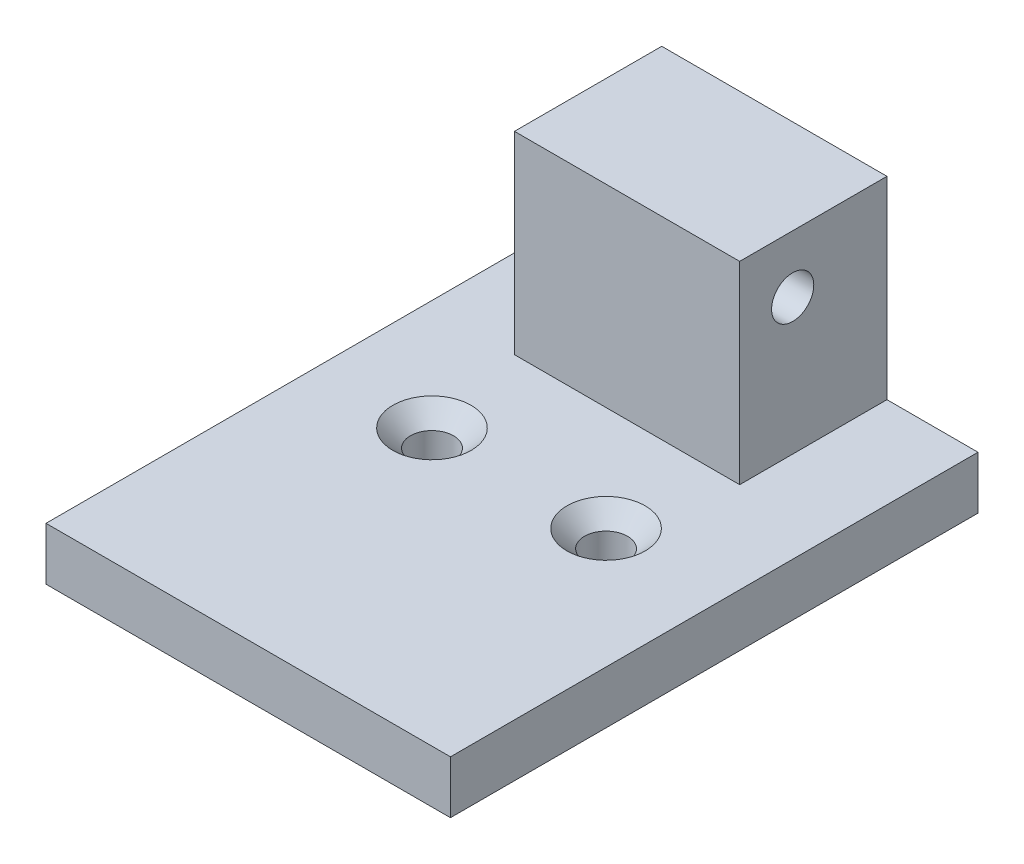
ISO-10303-21;
HEADER;
FILE_DESCRIPTION(('STEP AP214'),'2;1');
FILE_NAME('part.step','',(''),(''),'','','');
FILE_SCHEMA(('AUTOMOTIVE_DESIGN { 1 0 10303 214 1 1 1 1 }'));
ENDSEC;
DATA;
#1=APPLICATION_CONTEXT('core data for automotive mechanical design processes');
#2=APPLICATION_PROTOCOL_DEFINITION('international standard','automotive_design',2000,#1);
#3=PRODUCT_CONTEXT('',#1,'mechanical');
#4=PRODUCT('Part','Part','',(#3));
#5=PRODUCT_RELATED_PRODUCT_CATEGORY('part','',(#4));
#6=PRODUCT_DEFINITION_FORMATION('','',#4);
#7=PRODUCT_DEFINITION_CONTEXT('part definition',#1,'design');
#8=PRODUCT_DEFINITION('design','',#6,#7);
#9=PRODUCT_DEFINITION_SHAPE('','',#8);
#10=(LENGTH_UNIT() NAMED_UNIT(*) SI_UNIT(.MILLI.,.METRE.));
#11=(NAMED_UNIT(*) PLANE_ANGLE_UNIT() SI_UNIT($,.RADIAN.));
#12=(NAMED_UNIT(*) SI_UNIT($,.STERADIAN.) SOLID_ANGLE_UNIT());
#13=UNCERTAINTY_MEASURE_WITH_UNIT(LENGTH_MEASURE(1.E-05),#10,'distance_accuracy_value','');
#14=(GEOMETRIC_REPRESENTATION_CONTEXT(3) GLOBAL_UNCERTAINTY_ASSIGNED_CONTEXT((#13)) GLOBAL_UNIT_ASSIGNED_CONTEXT((#10,
#11,#12)) REPRESENTATION_CONTEXT('',''));
#15=CARTESIAN_POINT('',(0.,0.,0.));
#16=DIRECTION('',(0.,0.,1.));
#17=DIRECTION('',(1.,0.,0.));
#18=AXIS2_PLACEMENT_3D('',#15,#16,#17);
#19=CARTESIAN_POINT('',(0.,14.,0.));
#20=DIRECTION('',(0.,1.,0.));
#21=DIRECTION('',(0.,0.,1.));
#22=AXIS2_PLACEMENT_3D('',#19,#20,#21);
#23=PLANE('',#22);
#24=DIRECTION('',(-1.,0.,0.));
#25=VECTOR('',#24,1.);
#26=CARTESIAN_POINT('',(-20.2405151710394,14.,-5.94913889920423));
#27=LINE('',#26,#25);
#28=CARTESIAN_POINT('',(-20.9405151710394,14.,-5.94913889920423));
#29=VERTEX_POINT('',#28);
#30=CARTESIAN_POINT('',(-33.7485249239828,14.,-5.94913889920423));
#31=VERTEX_POINT('',#30);
#32=EDGE_CURVE('E115',#29,#31,#27,.T.);
#33=ORIENTED_EDGE('',*,*,#32,.F.);
#34=DIRECTION('',(0.,0.,1.));
#35=VECTOR('',#34,1.);
#36=CARTESIAN_POINT('',(-20.9405151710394,14.,-14.3252654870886));
#37=LINE('',#36,#35);
#38=CARTESIAN_POINT('',(-20.9405151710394,14.,-14.3252654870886));
#39=VERTEX_POINT('',#38);
#40=EDGE_CURVE('E50',#39,#29,#37,.T.);
#41=ORIENTED_EDGE('',*,*,#40,.F.);
#42=DIRECTION('',(-1.,0.,0.));
#43=VECTOR('',#42,1.);
#44=CARTESIAN_POINT('',(-34.4485249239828,14.,-14.3252654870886));
#45=LINE('',#44,#43);
#46=CARTESIAN_POINT('',(-33.7485249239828,14.,-14.3252654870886));
#47=VERTEX_POINT('',#46);
#48=EDGE_CURVE('E113',#39,#47,#45,.T.);
#49=ORIENTED_EDGE('',*,*,#48,.T.);
#50=DIRECTION('',(0.,0.,-1.));
#51=VECTOR('',#50,1.);
#52=CARTESIAN_POINT('',(-33.7485249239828,14.,-14.3252654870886));
#53=LINE('',#52,#51);
#54=EDGE_CURVE('E345',#31,#47,#53,.T.);
#55=ORIENTED_EDGE('',*,*,#54,.F.);
#56=EDGE_LOOP('',(#33,#41,#49,#55));
#57=FACE_BOUND('',#56,.T.);
#58=ADVANCED_FACE('F35',(#57),#23,.T.);
#59=CARTESIAN_POINT('',(-8.44852492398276,10.7325870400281,-8.96255173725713));
#60=DIRECTION('',(-1.,0.,0.));
#61=DIRECTION('',(0.,0.,1.));
#62=AXIS2_PLACEMENT_3D('',#59,#60,#61);
#63=CYLINDRICAL_SURFACE('',#62,1.2);
#64=CARTESIAN_POINT('',(-33.7485249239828,10.7325870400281,-8.96255173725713));
#65=DIRECTION('',(1.,0.,0.));
#66=DIRECTION('',(0.,0.,-1.));
#67=AXIS2_PLACEMENT_3D('',#64,#65,#66);
#68=CIRCLE('',#67,1.2);
#69=CARTESIAN_POINT('',(-33.7485249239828,10.7325870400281,-10.1625517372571));
#70=VERTEX_POINT('',#69);
#71=EDGE_CURVE('E354',#70,#70,#68,.F.);
#72=ORIENTED_EDGE('',*,*,#71,.T.);
#73=EDGE_LOOP('',(#72));
#74=FACE_BOUND('',#73,.T.);
#75=CARTESIAN_POINT('',(-20.9405151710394,10.7325870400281,-8.96255173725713));
#76=DIRECTION('',(1.,0.,0.));
#77=DIRECTION('',(0.,0.,-1.));
#78=AXIS2_PLACEMENT_3D('',#75,#76,#77);
#79=CIRCLE('',#78,1.2);
#80=CARTESIAN_POINT('',(-20.9405151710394,10.7325870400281,-10.1625517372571));
#81=VERTEX_POINT('',#80);
#82=EDGE_CURVE('E346',#81,#81,#79,.F.);
#83=ORIENTED_EDGE('',*,*,#82,.F.);
#84=EDGE_LOOP('',(#83));
#85=FACE_BOUND('',#84,.T.);
#86=ADVANCED_FACE('F202',(#74,#85),#63,.F.);
#87=CARTESIAN_POINT('',(0.,0.,-5.94913889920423));
#88=DIRECTION('',(0.,0.,1.));
#89=DIRECTION('',(1.,0.,0.));
#90=AXIS2_PLACEMENT_3D('',#87,#88,#89);
#91=PLANE('',#90);
#92=DIRECTION('',(1.,0.,0.));
#93=VECTOR('',#92,1.);
#94=CARTESIAN_POINT('',(-20.2405151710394,3.,-5.94913889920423));
#95=LINE('',#94,#93);
#96=CARTESIAN_POINT('',(-33.7485249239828,3.,-5.94913889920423));
#97=VERTEX_POINT('',#96);
#98=CARTESIAN_POINT('',(-20.9405151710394,3.,-5.94913889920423));
#99=VERTEX_POINT('',#98);
#100=EDGE_CURVE('E122',#97,#99,#95,.T.);
#101=ORIENTED_EDGE('',*,*,#100,.T.);
#102=DIRECTION('',(0.,-1.,0.));
#103=VECTOR('',#102,1.);
#104=CARTESIAN_POINT('',(-20.9405151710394,3.,-5.94913889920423));
#105=LINE('',#104,#103);
#106=EDGE_CURVE('E116',#29,#99,#105,.T.);
#107=ORIENTED_EDGE('',*,*,#106,.F.);
#108=ORIENTED_EDGE('',*,*,#32,.T.);
#109=DIRECTION('',(0.,1.,0.));
#110=VECTOR('',#109,1.);
#111=CARTESIAN_POINT('',(-33.7485249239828,3.,-5.94913889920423));
#112=LINE('',#111,#110);
#113=EDGE_CURVE('E342',#97,#31,#112,.T.);
#114=ORIENTED_EDGE('',*,*,#113,.F.);
#115=EDGE_LOOP('',(#101,#107,#108,#114));
#116=FACE_BOUND('',#115,.T.);
#117=ADVANCED_FACE('F206',(#116),#91,.T.);
#118=CARTESIAN_POINT('',(0.,3.,0.));
#119=DIRECTION('',(0.,1.,0.));
#120=DIRECTION('',(0.,0.,1.));
#121=AXIS2_PLACEMENT_3D('',#118,#119,#120);
#122=PLANE('',#121);
#123=DIRECTION('',(-1.,0.,0.));
#124=VECTOR('',#123,1.);
#125=CARTESIAN_POINT('',(-38.763553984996,3.,-14.3252654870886));
#126=LINE('',#125,#124);
#127=CARTESIAN_POINT('',(-15.7635539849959,3.,-14.3252654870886));
#128=VERTEX_POINT('',#127);
#129=CARTESIAN_POINT('',(-20.9405151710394,3.,-14.3252654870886));
#130=VERTEX_POINT('',#129);
#131=EDGE_CURVE('E143',#128,#130,#126,.T.);
#132=ORIENTED_EDGE('',*,*,#131,.T.);
#133=DIRECTION('',(0.,0.,-1.));
#134=VECTOR('',#133,1.);
#135=CARTESIAN_POINT('',(-20.9405151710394,3.,-14.3252654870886));
#136=LINE('',#135,#134);
#137=EDGE_CURVE('E105',#99,#130,#136,.T.);
#138=ORIENTED_EDGE('',*,*,#137,.F.);
#139=ORIENTED_EDGE('',*,*,#100,.F.);
#140=DIRECTION('',(0.,0.,1.));
#141=VECTOR('',#140,1.);
#142=CARTESIAN_POINT('',(-33.7485249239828,3.,-14.3252654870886));
#143=LINE('',#142,#141);
#144=CARTESIAN_POINT('',(-33.7485249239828,3.,-14.3252654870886));
#145=VERTEX_POINT('',#144);
#146=EDGE_CURVE('E58',#145,#97,#143,.T.);
#147=ORIENTED_EDGE('',*,*,#146,.F.);
#148=CARTESIAN_POINT('',(-38.763553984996,3.,-14.3252654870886));
#149=VERTEX_POINT('',#148);
#150=EDGE_CURVE('E142',#145,#149,#126,.T.);
#151=ORIENTED_EDGE('',*,*,#150,.T.);
#152=DIRECTION('',(0.,0.,1.));
#153=VECTOR('',#152,1.);
#154=CARTESIAN_POINT('',(-38.763553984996,3.,-14.3252654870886));
#155=LINE('',#154,#153);
#156=CARTESIAN_POINT('',(-38.7635539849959,3.,15.6747345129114));
#157=VERTEX_POINT('',#156);
#158=EDGE_CURVE('E134',#149,#157,#155,.T.);
#159=ORIENTED_EDGE('',*,*,#158,.T.);
#160=DIRECTION('',(1.,0.,0.));
#161=VECTOR('',#160,1.);
#162=CARTESIAN_POINT('',(-38.7635539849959,3.,15.6747345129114));
#163=LINE('',#162,#161);
#164=CARTESIAN_POINT('',(-15.7635539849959,3.,15.6747345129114));
#165=VERTEX_POINT('',#164);
#166=EDGE_CURVE('E137',#157,#165,#163,.T.);
#167=ORIENTED_EDGE('',*,*,#166,.T.);
#168=DIRECTION('',(0.,0.,-1.));
#169=VECTOR('',#168,1.);
#170=CARTESIAN_POINT('',(-15.7635539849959,3.,-14.3252654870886));
#171=LINE('',#170,#169);
#172=EDGE_CURVE('E140',#165,#128,#171,.T.);
#173=ORIENTED_EDGE('',*,*,#172,.T.);
#174=EDGE_LOOP('',(#132,#138,#139,#147,#151,#159,#167,#173));
#175=FACE_BOUND('',#174,.T.);
#176=CARTESIAN_POINT('',(-22.5895964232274,3.,0.));
#177=DIRECTION('',(0.,1.,0.));
#178=DIRECTION('',(0.,0.,1.));
#179=AXIS2_PLACEMENT_3D('',#176,#177,#178);
#180=CIRCLE('',#179,2.22510190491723);
#181=CARTESIAN_POINT('',(-22.5895964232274,3.,2.22510190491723));
#182=VERTEX_POINT('',#181);
#183=EDGE_CURVE('E43',#182,#182,#180,.F.);
#184=ORIENTED_EDGE('',*,*,#183,.T.);
#185=EDGE_LOOP('',(#184));
#186=FACE_BOUND('',#185,.T.);
#187=CARTESIAN_POINT('',(-32.4895964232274,3.,0.));
#188=DIRECTION('',(0.,1.,0.));
#189=DIRECTION('',(0.,0.,1.));
#190=AXIS2_PLACEMENT_3D('',#187,#188,#189);
#191=CIRCLE('',#190,2.22510190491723);
#192=CARTESIAN_POINT('',(-32.4895964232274,3.,2.22510190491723));
#193=VERTEX_POINT('',#192);
#194=EDGE_CURVE('E167',#193,#193,#191,.F.);
#195=ORIENTED_EDGE('',*,*,#194,.T.);
#196=EDGE_LOOP('',(#195));
#197=FACE_BOUND('',#196,.T.);
#198=ADVANCED_FACE('F172',(#175,#186,#197),#122,.T.);
#199=CARTESIAN_POINT('',(0.,0.,0.));
#200=DIRECTION('',(0.,1.,0.));
#201=DIRECTION('',(0.,0.,1.));
#202=AXIS2_PLACEMENT_3D('',#199,#200,#201);
#203=PLANE('',#202);
#204=DIRECTION('',(0.,0.,1.));
#205=VECTOR('',#204,1.);
#206=CARTESIAN_POINT('',(-38.763553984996,0.,-14.3252654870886));
#207=LINE('',#206,#205);
#208=CARTESIAN_POINT('',(-38.763553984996,0.,-14.3252654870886));
#209=VERTEX_POINT('',#208);
#210=CARTESIAN_POINT('',(-38.7635539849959,0.,15.6747345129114));
#211=VERTEX_POINT('',#210);
#212=EDGE_CURVE('E133',#209,#211,#207,.T.);
#213=ORIENTED_EDGE('',*,*,#212,.F.);
#214=DIRECTION('',(-1.,0.,0.));
#215=VECTOR('',#214,1.);
#216=CARTESIAN_POINT('',(-38.763553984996,0.,-14.3252654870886));
#217=LINE('',#216,#215);
#218=CARTESIAN_POINT('',(-15.7635539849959,0.,-14.3252654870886));
#219=VERTEX_POINT('',#218);
#220=EDGE_CURVE('E138',#219,#209,#217,.T.);
#221=ORIENTED_EDGE('',*,*,#220,.F.);
#222=DIRECTION('',(0.,0.,-1.));
#223=VECTOR('',#222,1.);
#224=CARTESIAN_POINT('',(-15.7635539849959,0.,-14.3252654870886));
#225=LINE('',#224,#223);
#226=CARTESIAN_POINT('',(-15.7635539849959,0.,15.6747345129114));
#227=VERTEX_POINT('',#226);
#228=EDGE_CURVE('E150',#227,#219,#225,.T.);
#229=ORIENTED_EDGE('',*,*,#228,.F.);
#230=DIRECTION('',(1.,0.,0.));
#231=VECTOR('',#230,1.);
#232=CARTESIAN_POINT('',(-38.7635539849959,0.,15.6747345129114));
#233=LINE('',#232,#231);
#234=EDGE_CURVE('E148',#211,#227,#233,.T.);
#235=ORIENTED_EDGE('',*,*,#234,.F.);
#236=EDGE_LOOP('',(#213,#221,#229,#235));
#237=FACE_BOUND('',#236,.T.);
#238=CARTESIAN_POINT('',(-22.5895964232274,0.,0.));
#239=DIRECTION('',(0.,1.,0.));
#240=DIRECTION('',(0.,0.,1.));
#241=AXIS2_PLACEMENT_3D('',#238,#239,#240);
#242=CIRCLE('',#241,1.22510190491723);
#243=CARTESIAN_POINT('',(-22.5895964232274,0.,1.22510190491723));
#244=VERTEX_POINT('',#243);
#245=EDGE_CURVE('E125',#244,#244,#242,.T.);
#246=ORIENTED_EDGE('',*,*,#245,.T.);
#247=EDGE_LOOP('',(#246));
#248=FACE_BOUND('',#247,.T.);
#249=CARTESIAN_POINT('',(-32.4895964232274,0.,0.));
#250=DIRECTION('',(0.,1.,0.));
#251=DIRECTION('',(0.,0.,1.));
#252=AXIS2_PLACEMENT_3D('',#249,#250,#251);
#253=CIRCLE('',#252,1.22510190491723);
#254=CARTESIAN_POINT('',(-32.4895964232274,0.,1.22510190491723));
#255=VERTEX_POINT('',#254);
#256=EDGE_CURVE('E121',#255,#255,#253,.T.);
#257=ORIENTED_EDGE('',*,*,#256,.T.);
#258=EDGE_LOOP('',(#257));
#259=FACE_BOUND('',#258,.T.);
#260=ADVANCED_FACE('F187',(#237,#248,#259),#203,.F.);
#261=CARTESIAN_POINT('',(-38.763553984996,3.,-14.3252654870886));
#262=DIRECTION('',(1.,0.,0.));
#263=DIRECTION('',(0.,0.,-1.));
#264=AXIS2_PLACEMENT_3D('',#261,#262,#263);
#265=PLANE('',#264);
#266=ORIENTED_EDGE('',*,*,#212,.T.);
#267=DIRECTION('',(0.,-1.,0.));
#268=VECTOR('',#267,1.);
#269=CARTESIAN_POINT('',(-38.7635539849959,3.,15.6747345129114));
#270=LINE('',#269,#268);
#271=EDGE_CURVE('E161',#157,#211,#270,.T.);
#272=ORIENTED_EDGE('',*,*,#271,.F.);
#273=ORIENTED_EDGE('',*,*,#158,.F.);
#274=DIRECTION('',(0.,-1.,0.));
#275=VECTOR('',#274,1.);
#276=CARTESIAN_POINT('',(-38.763553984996,3.,-14.3252654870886));
#277=LINE('',#276,#275);
#278=EDGE_CURVE('E145',#149,#209,#277,.T.);
#279=ORIENTED_EDGE('',*,*,#278,.T.);
#280=EDGE_LOOP('',(#266,#272,#273,#279));
#281=FACE_BOUND('',#280,.T.);
#282=ADVANCED_FACE('F190',(#281),#265,.F.);
#283=CARTESIAN_POINT('',(-38.7635539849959,3.,15.6747345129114));
#284=DIRECTION('',(0.,0.,-1.));
#285=DIRECTION('',(-1.,0.,0.));
#286=AXIS2_PLACEMENT_3D('',#283,#284,#285);
#287=PLANE('',#286);
#288=ORIENTED_EDGE('',*,*,#234,.T.);
#289=DIRECTION('',(0.,-1.,0.));
#290=VECTOR('',#289,1.);
#291=CARTESIAN_POINT('',(-15.7635539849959,3.,15.6747345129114));
#292=LINE('',#291,#290);
#293=EDGE_CURVE('E158',#165,#227,#292,.T.);
#294=ORIENTED_EDGE('',*,*,#293,.F.);
#295=ORIENTED_EDGE('',*,*,#166,.F.);
#296=ORIENTED_EDGE('',*,*,#271,.T.);
#297=EDGE_LOOP('',(#288,#294,#295,#296));
#298=FACE_BOUND('',#297,.T.);
#299=ADVANCED_FACE('F256',(#298),#287,.F.);
#300=CARTESIAN_POINT('',(-15.7635539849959,3.,-14.3252654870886));
#301=DIRECTION('',(-1.,0.,0.));
#302=DIRECTION('',(0.,0.,1.));
#303=AXIS2_PLACEMENT_3D('',#300,#301,#302);
#304=PLANE('',#303);
#305=ORIENTED_EDGE('',*,*,#228,.T.);
#306=DIRECTION('',(0.,-1.,0.));
#307=VECTOR('',#306,1.);
#308=CARTESIAN_POINT('',(-15.7635539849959,3.,-14.3252654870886));
#309=LINE('',#308,#307);
#310=EDGE_CURVE('E155',#128,#219,#309,.T.);
#311=ORIENTED_EDGE('',*,*,#310,.F.);
#312=ORIENTED_EDGE('',*,*,#172,.F.);
#313=ORIENTED_EDGE('',*,*,#293,.T.);
#314=EDGE_LOOP('',(#305,#311,#312,#313));
#315=FACE_BOUND('',#314,.T.);
#316=ADVANCED_FACE('F251',(#315),#304,.F.);
#317=CARTESIAN_POINT('',(-38.763553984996,3.,-14.3252654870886));
#318=DIRECTION('',(0.,0.,1.));
#319=DIRECTION('',(1.,0.,0.));
#320=AXIS2_PLACEMENT_3D('',#317,#318,#319);
#321=PLANE('',#320);
#322=DIRECTION('',(0.,1.,0.));
#323=VECTOR('',#322,1.);
#324=CARTESIAN_POINT('',(-20.9405151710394,3.,-14.3252654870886));
#325=LINE('',#324,#323);
#326=EDGE_CURVE('E101',#130,#39,#325,.T.);
#327=ORIENTED_EDGE('',*,*,#326,.F.);
#328=ORIENTED_EDGE('',*,*,#131,.F.);
#329=ORIENTED_EDGE('',*,*,#310,.T.);
#330=ORIENTED_EDGE('',*,*,#220,.T.);
#331=ORIENTED_EDGE('',*,*,#278,.F.);
#332=ORIENTED_EDGE('',*,*,#150,.F.);
#333=DIRECTION('',(0.,-1.,0.));
#334=VECTOR('',#333,1.);
#335=CARTESIAN_POINT('',(-33.7485249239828,3.,-14.3252654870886));
#336=LINE('',#335,#334);
#337=EDGE_CURVE('E120',#47,#145,#336,.T.);
#338=ORIENTED_EDGE('',*,*,#337,.F.);
#339=ORIENTED_EDGE('',*,*,#48,.F.);
#340=EDGE_LOOP('',(#327,#328,#329,#330,#331,#332,#338,#339));
#341=FACE_BOUND('',#340,.T.);
#342=ADVANCED_FACE('F119',(#341),#321,.F.);
#343=CARTESIAN_POINT('',(-22.5895964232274,3.,0.));
#344=DIRECTION('',(0.,-1.,0.));
#345=DIRECTION('',(0.,0.,-1.));
#346=AXIS2_PLACEMENT_3D('',#343,#344,#345);
#347=CYLINDRICAL_SURFACE('',#346,1.22510190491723);
#348=CARTESIAN_POINT('',(-22.5895964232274,2.,0.));
#349=DIRECTION('',(0.,1.,0.));
#350=DIRECTION('',(0.,0.,1.));
#351=AXIS2_PLACEMENT_3D('',#348,#349,#350);
#352=CIRCLE('',#351,1.22510190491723);
#353=CARTESIAN_POINT('',(-22.5895964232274,2.,1.22510190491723));
#354=VERTEX_POINT('',#353);
#355=EDGE_CURVE('E164',#354,#354,#352,.T.);
#356=ORIENTED_EDGE('',*,*,#355,.T.);
#357=EDGE_LOOP('',(#356));
#358=FACE_BOUND('',#357,.T.);
#359=ORIENTED_EDGE('',*,*,#245,.F.);
#360=EDGE_LOOP('',(#359));
#361=FACE_BOUND('',#360,.T.);
#362=ADVANCED_FACE('F181',(#358,#361),#347,.F.);
#363=CARTESIAN_POINT('',(-32.4895964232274,3.,0.));
#364=DIRECTION('',(0.,-1.,0.));
#365=DIRECTION('',(0.,0.,-1.));
#366=AXIS2_PLACEMENT_3D('',#363,#364,#365);
#367=CYLINDRICAL_SURFACE('',#366,1.22510190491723);
#368=CARTESIAN_POINT('',(-32.4895964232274,2.,0.));
#369=DIRECTION('',(0.,1.,0.));
#370=DIRECTION('',(0.,0.,1.));
#371=AXIS2_PLACEMENT_3D('',#368,#369,#370);
#372=CIRCLE('',#371,1.22510190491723);
#373=CARTESIAN_POINT('',(-32.4895964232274,2.,1.22510190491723));
#374=VERTEX_POINT('',#373);
#375=EDGE_CURVE('E11',#374,#374,#372,.T.);
#376=ORIENTED_EDGE('',*,*,#375,.T.);
#377=EDGE_LOOP('',(#376));
#378=FACE_BOUND('',#377,.T.);
#379=ORIENTED_EDGE('',*,*,#256,.F.);
#380=EDGE_LOOP('',(#379));
#381=FACE_BOUND('',#380,.T.);
#382=ADVANCED_FACE('F178',(#378,#381),#367,.F.);
#383=CARTESIAN_POINT('',(-22.5895964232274,2.,0.));
#384=DIRECTION('',(0.,1.,0.));
#385=DIRECTION('',(0.,0.,1.));
#386=AXIS2_PLACEMENT_3D('',#383,#384,#385);
#387=CONICAL_SURFACE('',#386,1.22510190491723,0.785398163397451);
#388=ORIENTED_EDGE('',*,*,#183,.F.);
#389=EDGE_LOOP('',(#388));
#390=FACE_BOUND('',#389,.T.);
#391=ORIENTED_EDGE('',*,*,#355,.F.);
#392=EDGE_LOOP('',(#391));
#393=FACE_BOUND('',#392,.T.);
#394=ADVANCED_FACE('F175',(#390,#393),#387,.F.);
#395=CARTESIAN_POINT('',(-32.4895964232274,2.,0.));
#396=DIRECTION('',(0.,1.,0.));
#397=DIRECTION('',(0.,0.,1.));
#398=AXIS2_PLACEMENT_3D('',#395,#396,#397);
#399=CONICAL_SURFACE('',#398,1.22510190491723,0.785398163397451);
#400=ORIENTED_EDGE('',*,*,#194,.F.);
#401=EDGE_LOOP('',(#400));
#402=FACE_BOUND('',#401,.T.);
#403=ORIENTED_EDGE('',*,*,#375,.F.);
#404=EDGE_LOOP('',(#403));
#405=FACE_BOUND('',#404,.T.);
#406=ADVANCED_FACE('F37',(#402,#405),#399,.F.);
#407=CARTESIAN_POINT('',(-33.7485249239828,0.,0.));
#408=DIRECTION('',(1.,0.,0.));
#409=DIRECTION('',(0.,0.,-1.));
#410=AXIS2_PLACEMENT_3D('',#407,#408,#409);
#411=PLANE('',#410);
#412=ORIENTED_EDGE('',*,*,#337,.T.);
#413=ORIENTED_EDGE('',*,*,#146,.T.);
#414=ORIENTED_EDGE('',*,*,#113,.T.);
#415=ORIENTED_EDGE('',*,*,#54,.T.);
#416=EDGE_LOOP('',(#412,#413,#414,#415));
#417=FACE_BOUND('',#416,.T.);
#418=ORIENTED_EDGE('',*,*,#71,.F.);
#419=EDGE_LOOP('',(#418));
#420=FACE_BOUND('',#419,.T.);
#421=ADVANCED_FACE('F213',(#417,#420),#411,.F.);
#422=CARTESIAN_POINT('',(-20.9405151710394,0.,0.));
#423=DIRECTION('',(1.,0.,0.));
#424=DIRECTION('',(0.,0.,-1.));
#425=AXIS2_PLACEMENT_3D('',#422,#423,#424);
#426=PLANE('',#425);
#427=ORIENTED_EDGE('',*,*,#326,.T.);
#428=ORIENTED_EDGE('',*,*,#40,.T.);
#429=ORIENTED_EDGE('',*,*,#106,.T.);
#430=ORIENTED_EDGE('',*,*,#137,.T.);
#431=EDGE_LOOP('',(#427,#428,#429,#430));
#432=FACE_BOUND('',#431,.T.);
#433=ORIENTED_EDGE('',*,*,#82,.T.);
#434=EDGE_LOOP('',(#433));
#435=FACE_BOUND('',#434,.T.);
#436=ADVANCED_FACE('F102',(#432,#435),#426,.T.);
#437=CLOSED_SHELL('',(#58,#86,#117,#198,#260,#282,#299,#316,#342,#362,#382,#394,#406,#421,#436));
#438=MANIFOLD_SOLID_BREP('B2',#437);
#439=ADVANCED_BREP_SHAPE_REPRESENTATION('',(#18,#438),#14);
#440=SHAPE_DEFINITION_REPRESENTATION(#9,#439);
ENDSEC;
END-ISO-10303-21;
